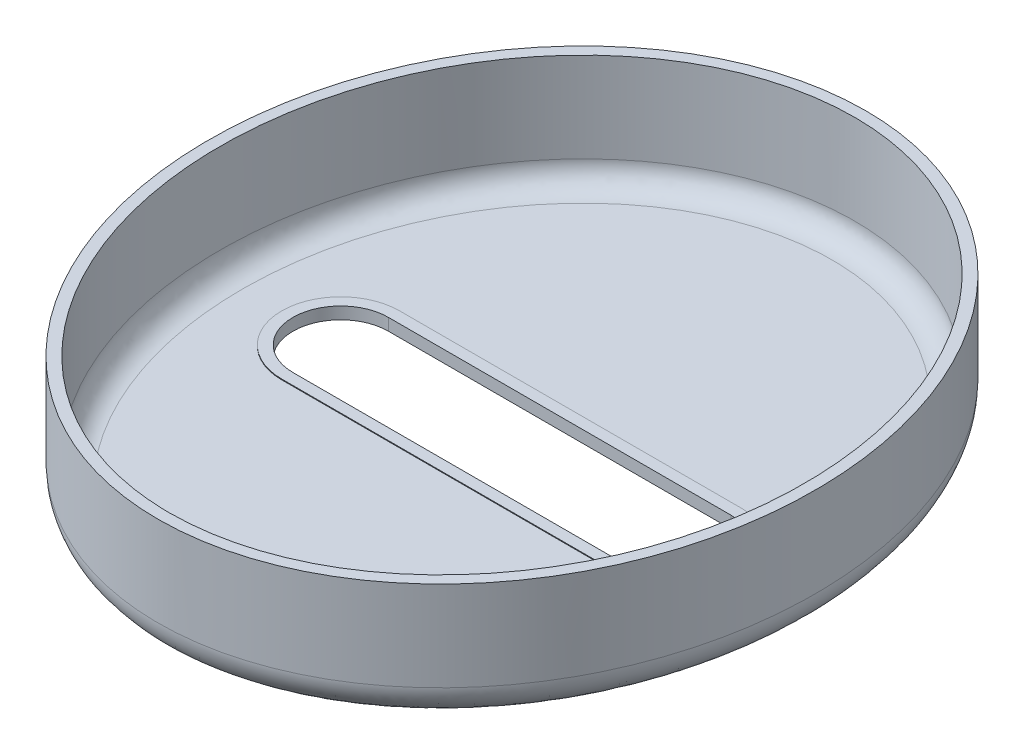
from build123d import *

# Parameters (mm, degrees)
SKETCH_1_RX         = 31.5
SKETCH_1_RY         = 27
EXTRUDE_2_DEPTH     = 11
SHELL_2_T           = -1
FILLET_1_R          = 3
SKETCH_6_W          = 41.68977524
SKETCH_6_H          = 10.292579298
CUT_EXTRUDE_2_DEPTH = 12
FILLET_2_R          = 2
CUT_EXTRUDE_3_DEPTH = 0.5


with BuildPart() as part:
    # Sketch 1 → Extrude 2 (new body)
    with BuildSketch(Plane(origin=(0, 0, 0), x_dir=(1, 0, 0), z_dir=(0, 1, 0))):
        with Locations(Location((0, 0), (0, 0, 90))):
            Ellipse(SKETCH_1_RX, SKETCH_1_RY)
        with BuildLine():
            Line((-15.25, -4.25), (15.25, -4.25))
            ThreePointArc((15.25, -4.25), (19.5, 0), (15.25, 4.25))
            Line((15.25, 4.25), (-15.25, 4.25))
            ThreePointArc((-15.25, 4.25), (-19.5, 0), (-15.25, -4.25))
        make_face(mode=Mode.SUBTRACT)
    extrude(amount=EXTRUDE_2_DEPTH)

    # Shell 2
    shell_2_openings = [part.faces().sort_by_distance(p)[0] for p in [
        (0.001295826, 11, 30.670240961),
    ]]
    offset(amount=SHELL_2_T, openings=shell_2_openings, kind=Kind.INTERSECTION)

    # Fillet 1
    fillet_1_edges = [part.edges().sort_by_distance(p)[0] for p in [
        (0.001344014, 0, 31.499999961),
    ]]
    fillet(fillet_1_edges, radius=FILLET_1_R)

    # Sketch 6 → Cut-Extrude 2 (cut)
    with BuildSketch(Plane.XY.offset(5.25)):
        with Locations((0.260631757, 6.214859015)):
            Rectangle(SKETCH_6_W, SKETCH_6_H)
    extrude(amount=-CUT_EXTRUDE_2_DEPTH, mode=Mode.SUBTRACT)

    # Fillet 2
    fillet_2_edges = [part.edges().sort_by_distance(p)[0] for p in [
        (-2.4e-08, 1, 30.500000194),
    ]]
    fillet(fillet_2_edges, radius=FILLET_2_R)

    # Sketch 1_53 → Cut-Extrude 3 (cut)
    with BuildSketch(Plane(origin=(0, 0, 0), x_dir=(1, 0, 0), z_dir=(0, 1, 0))):
        Polygon((-5.196152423, -16.122293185), (-0.066527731, -16.122293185), (-0.033263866, -16.064678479), (-2.598076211, -11.622293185), (-7.794228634, -11.622293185), align=None)
        Polygon((0, -25.122293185), (2.598076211, -20.622293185), (0.033263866, -16.17990789), (-0.033263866, -16.17990789), (-2.598076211, -20.622293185), align=None)
        Polygon((5.196152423, -16.122293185), (7.794228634, -11.622293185), (2.598076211, -11.622293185), (0.033263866, -16.064678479), (0.066527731, -16.122293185), align=None)
    extrude(amount=CUT_EXTRUDE_3_DEPTH, mode=Mode.SUBTRACT)


solid = part.part
